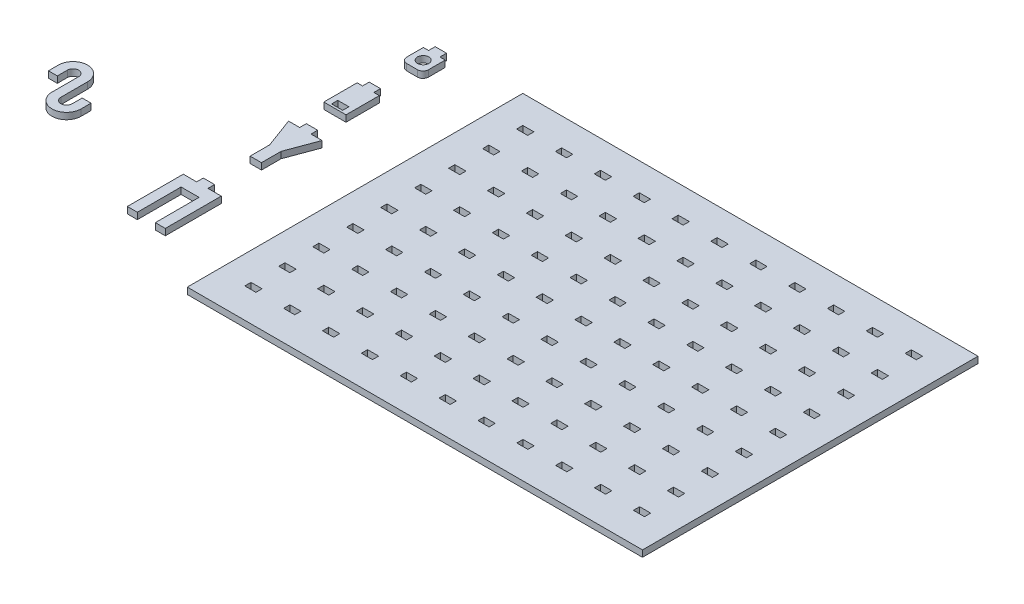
from build123d import *

# Parameters (mm, degrees)
SKETCH1_W             = 410
SKETCH1_H             = 302.2
SKETCH1_W_2           = 10
SKETCH1_H_2           = 5.6
BOSS_EXTRUDE5_DEPTH   = 5.8
SKETCH1_R             = 5.126
BOSS_EXTRUDE5_2_DEPTH = 5.8
BOSS_EXTRUDE5_3_DEPTH = 5.8
BOSS_EXTRUDE5_4_DEPTH = 5.8
BOSS_EXTRUDE5_5_DEPTH = 5.8
BOSS_EXTRUDE5_6_DEPTH = 5.8


with BuildPart() as part:
    # Sketch1 → Boss-Extrude5 (new body)
    with BuildSketch(Plane(origin=(0, 0, 0), x_dir=(1, 0, 0), z_dir=(0, 1, 0))):
        with Locations((5, -3.685365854)):
            Rectangle(SKETCH1_W, SKETCH1_H)
        with Locations((-135, 119.614634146)):
            Rectangle(SKETCH1_W_2, SKETCH1_H_2, mode=Mode.SUBTRACT)
        with Locations((-170, 119.614634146)):
            Rectangle(SKETCH1_W_2, SKETCH1_H_2, mode=Mode.SUBTRACT)
        with Locations((-100, 119.614634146)):
            Rectangle(SKETCH1_W_2, SKETCH1_H_2, mode=Mode.SUBTRACT)
        with Locations((-65, 119.614634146)):
            Rectangle(SKETCH1_W_2, SKETCH1_H_2, mode=Mode.SUBTRACT)
        with Locations((-30, 119.614634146)):
            Rectangle(SKETCH1_W_2, SKETCH1_H_2, mode=Mode.SUBTRACT)
        with Locations((5, 119.614634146)):
            Rectangle(SKETCH1_W_2, SKETCH1_H_2, mode=Mode.SUBTRACT)
        with Locations((40, 119.614634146)):
            Rectangle(SKETCH1_W_2, SKETCH1_H_2, mode=Mode.SUBTRACT)
        with Locations((75, 119.614634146)):
            Rectangle(SKETCH1_W_2, SKETCH1_H_2, mode=Mode.SUBTRACT)
        with Locations((110, 119.614634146)):
            Rectangle(SKETCH1_W_2, SKETCH1_H_2, mode=Mode.SUBTRACT)
        with Locations((145, 119.614634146)):
            Rectangle(SKETCH1_W_2, SKETCH1_H_2, mode=Mode.SUBTRACT)
        with Locations((180, 119.614634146)):
            Rectangle(SKETCH1_W_2, SKETCH1_H_2, mode=Mode.SUBTRACT)
        with Locations((-135, 89.014634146)):
            Rectangle(SKETCH1_W_2, SKETCH1_H_2, mode=Mode.SUBTRACT)
        with Locations((-100, 89.014634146)):
            Rectangle(SKETCH1_W_2, SKETCH1_H_2, mode=Mode.SUBTRACT)
        with Locations((-65, 89.014634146)):
            Rectangle(SKETCH1_W_2, SKETCH1_H_2, mode=Mode.SUBTRACT)
        with Locations((-30, 89.014634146)):
            Rectangle(SKETCH1_W_2, SKETCH1_H_2, mode=Mode.SUBTRACT)
        with Locations((5, 89.014634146)):
            Rectangle(SKETCH1_W_2, SKETCH1_H_2, mode=Mode.SUBTRACT)
        with Locations((40, 89.014634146)):
            Rectangle(SKETCH1_W_2, SKETCH1_H_2, mode=Mode.SUBTRACT)
        with Locations((75, 89.014634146)):
            Rectangle(SKETCH1_W_2, SKETCH1_H_2, mode=Mode.SUBTRACT)
        with Locations((110, 89.014634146)):
            Rectangle(SKETCH1_W_2, SKETCH1_H_2, mode=Mode.SUBTRACT)
        with Locations((145, 89.014634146)):
            Rectangle(SKETCH1_W_2, SKETCH1_H_2, mode=Mode.SUBTRACT)
        with Locations((180, 89.014634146)):
            Rectangle(SKETCH1_W_2, SKETCH1_H_2, mode=Mode.SUBTRACT)
        with Locations((-135, 58.414634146)):
            Rectangle(SKETCH1_W_2, SKETCH1_H_2, mode=Mode.SUBTRACT)
        with Locations((-100, 58.414634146)):
            Rectangle(SKETCH1_W_2, SKETCH1_H_2, mode=Mode.SUBTRACT)
        with Locations((-65, 58.414634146)):
            Rectangle(SKETCH1_W_2, SKETCH1_H_2, mode=Mode.SUBTRACT)
        with Locations((-30, 58.414634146)):
            Rectangle(SKETCH1_W_2, SKETCH1_H_2, mode=Mode.SUBTRACT)
        with Locations((5, 58.414634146)):
            Rectangle(SKETCH1_W_2, SKETCH1_H_2, mode=Mode.SUBTRACT)
        with Locations((40, 58.414634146)):
            Rectangle(SKETCH1_W_2, SKETCH1_H_2, mode=Mode.SUBTRACT)
        with Locations((75, 58.414634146)):
            Rectangle(SKETCH1_W_2, SKETCH1_H_2, mode=Mode.SUBTRACT)
        with Locations((110, 58.414634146)):
            Rectangle(SKETCH1_W_2, SKETCH1_H_2, mode=Mode.SUBTRACT)
        with Locations((145, 58.414634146)):
            Rectangle(SKETCH1_W_2, SKETCH1_H_2, mode=Mode.SUBTRACT)
        with Locations((180, 58.414634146)):
            Rectangle(SKETCH1_W_2, SKETCH1_H_2, mode=Mode.SUBTRACT)
        with Locations((-135, 27.814634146)):
            Rectangle(SKETCH1_W_2, SKETCH1_H_2, mode=Mode.SUBTRACT)
        with Locations((-100, 27.814634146)):
            Rectangle(SKETCH1_W_2, SKETCH1_H_2, mode=Mode.SUBTRACT)
        with Locations((-65, 27.814634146)):
            Rectangle(SKETCH1_W_2, SKETCH1_H_2, mode=Mode.SUBTRACT)
        with Locations((-30, 27.814634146)):
            Rectangle(SKETCH1_W_2, SKETCH1_H_2, mode=Mode.SUBTRACT)
        with Locations((5, 27.814634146)):
            Rectangle(SKETCH1_W_2, SKETCH1_H_2, mode=Mode.SUBTRACT)
        with Locations((40, 27.814634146)):
            Rectangle(SKETCH1_W_2, SKETCH1_H_2, mode=Mode.SUBTRACT)
        with Locations((75, 27.814634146)):
            Rectangle(SKETCH1_W_2, SKETCH1_H_2, mode=Mode.SUBTRACT)
        with Locations((110, 27.814634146)):
            Rectangle(SKETCH1_W_2, SKETCH1_H_2, mode=Mode.SUBTRACT)
        with Locations((145, 27.814634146)):
            Rectangle(SKETCH1_W_2, SKETCH1_H_2, mode=Mode.SUBTRACT)
        with Locations((180, 27.814634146)):
            Rectangle(SKETCH1_W_2, SKETCH1_H_2, mode=Mode.SUBTRACT)
        with Locations((-135, -2.785365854)):
            Rectangle(SKETCH1_W_2, SKETCH1_H_2, mode=Mode.SUBTRACT)
        with Locations((-100, -2.785365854)):
            Rectangle(SKETCH1_W_2, SKETCH1_H_2, mode=Mode.SUBTRACT)
        with Locations((-65, -2.785365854)):
            Rectangle(SKETCH1_W_2, SKETCH1_H_2, mode=Mode.SUBTRACT)
        with Locations((-30, -2.785365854)):
            Rectangle(SKETCH1_W_2, SKETCH1_H_2, mode=Mode.SUBTRACT)
        with Locations((5, -2.785365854)):
            Rectangle(SKETCH1_W_2, SKETCH1_H_2, mode=Mode.SUBTRACT)
        with Locations((40, -2.785365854)):
            Rectangle(SKETCH1_W_2, SKETCH1_H_2, mode=Mode.SUBTRACT)
        with Locations((75, -2.785365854)):
            Rectangle(SKETCH1_W_2, SKETCH1_H_2, mode=Mode.SUBTRACT)
        with Locations((110, -2.785365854)):
            Rectangle(SKETCH1_W_2, SKETCH1_H_2, mode=Mode.SUBTRACT)
        with Locations((145, -2.785365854)):
            Rectangle(SKETCH1_W_2, SKETCH1_H_2, mode=Mode.SUBTRACT)
        with Locations((180, -2.785365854)):
            Rectangle(SKETCH1_W_2, SKETCH1_H_2, mode=Mode.SUBTRACT)
        with Locations((-135, -33.385365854)):
            Rectangle(SKETCH1_W_2, SKETCH1_H_2, mode=Mode.SUBTRACT)
        with Locations((-100, -33.385365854)):
            Rectangle(SKETCH1_W_2, SKETCH1_H_2, mode=Mode.SUBTRACT)
        with Locations((-65, -33.385365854)):
            Rectangle(SKETCH1_W_2, SKETCH1_H_2, mode=Mode.SUBTRACT)
        with Locations((-30, -33.385365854)):
            Rectangle(SKETCH1_W_2, SKETCH1_H_2, mode=Mode.SUBTRACT)
        with Locations((5, -33.385365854)):
            Rectangle(SKETCH1_W_2, SKETCH1_H_2, mode=Mode.SUBTRACT)
        with Locations((40, -33.385365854)):
            Rectangle(SKETCH1_W_2, SKETCH1_H_2, mode=Mode.SUBTRACT)
        with Locations((75, -33.385365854)):
            Rectangle(SKETCH1_W_2, SKETCH1_H_2, mode=Mode.SUBTRACT)
        with Locations((110, -33.385365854)):
            Rectangle(SKETCH1_W_2, SKETCH1_H_2, mode=Mode.SUBTRACT)
        with Locations((145, -33.385365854)):
            Rectangle(SKETCH1_W_2, SKETCH1_H_2, mode=Mode.SUBTRACT)
        with Locations((180, -33.385365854)):
            Rectangle(SKETCH1_W_2, SKETCH1_H_2, mode=Mode.SUBTRACT)
        with Locations((-135, -63.985365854)):
            Rectangle(SKETCH1_W_2, SKETCH1_H_2, mode=Mode.SUBTRACT)
        with Locations((-100, -63.985365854)):
            Rectangle(SKETCH1_W_2, SKETCH1_H_2, mode=Mode.SUBTRACT)
        with Locations((-65, -63.985365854)):
            Rectangle(SKETCH1_W_2, SKETCH1_H_2, mode=Mode.SUBTRACT)
        with Locations((-30, -63.985365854)):
            Rectangle(SKETCH1_W_2, SKETCH1_H_2, mode=Mode.SUBTRACT)
        with Locations((5, -63.985365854)):
            Rectangle(SKETCH1_W_2, SKETCH1_H_2, mode=Mode.SUBTRACT)
        with Locations((40, -63.985365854)):
            Rectangle(SKETCH1_W_2, SKETCH1_H_2, mode=Mode.SUBTRACT)
        with Locations((75, -63.985365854)):
            Rectangle(SKETCH1_W_2, SKETCH1_H_2, mode=Mode.SUBTRACT)
        with Locations((110, -63.985365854)):
            Rectangle(SKETCH1_W_2, SKETCH1_H_2, mode=Mode.SUBTRACT)
        with Locations((145, -63.985365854)):
            Rectangle(SKETCH1_W_2, SKETCH1_H_2, mode=Mode.SUBTRACT)
        with Locations((180, -63.985365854)):
            Rectangle(SKETCH1_W_2, SKETCH1_H_2, mode=Mode.SUBTRACT)
        with Locations((-135, -94.585365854)):
            Rectangle(SKETCH1_W_2, SKETCH1_H_2, mode=Mode.SUBTRACT)
        with Locations((-100, -94.585365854)):
            Rectangle(SKETCH1_W_2, SKETCH1_H_2, mode=Mode.SUBTRACT)
        with Locations((-65, -94.585365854)):
            Rectangle(SKETCH1_W_2, SKETCH1_H_2, mode=Mode.SUBTRACT)
        with Locations((-30, -94.585365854)):
            Rectangle(SKETCH1_W_2, SKETCH1_H_2, mode=Mode.SUBTRACT)
        with Locations((5, -94.585365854)):
            Rectangle(SKETCH1_W_2, SKETCH1_H_2, mode=Mode.SUBTRACT)
        with Locations((40, -94.585365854)):
            Rectangle(SKETCH1_W_2, SKETCH1_H_2, mode=Mode.SUBTRACT)
        with Locations((75, -94.585365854)):
            Rectangle(SKETCH1_W_2, SKETCH1_H_2, mode=Mode.SUBTRACT)
        with Locations((110, -94.585365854)):
            Rectangle(SKETCH1_W_2, SKETCH1_H_2, mode=Mode.SUBTRACT)
        with Locations((145, -94.585365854)):
            Rectangle(SKETCH1_W_2, SKETCH1_H_2, mode=Mode.SUBTRACT)
        with Locations((180, -94.585365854)):
            Rectangle(SKETCH1_W_2, SKETCH1_H_2, mode=Mode.SUBTRACT)
        with Locations((-135, -125.185365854)):
            Rectangle(SKETCH1_W_2, SKETCH1_H_2, mode=Mode.SUBTRACT)
        with Locations((-100, -125.185365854)):
            Rectangle(SKETCH1_W_2, SKETCH1_H_2, mode=Mode.SUBTRACT)
        with Locations((-65, -125.185365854)):
            Rectangle(SKETCH1_W_2, SKETCH1_H_2, mode=Mode.SUBTRACT)
        with Locations((-30, -125.185365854)):
            Rectangle(SKETCH1_W_2, SKETCH1_H_2, mode=Mode.SUBTRACT)
        with Locations((5, -125.185365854)):
            Rectangle(SKETCH1_W_2, SKETCH1_H_2, mode=Mode.SUBTRACT)
        with Locations((40, -125.185365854)):
            Rectangle(SKETCH1_W_2, SKETCH1_H_2, mode=Mode.SUBTRACT)
        with Locations((75, -125.185365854)):
            Rectangle(SKETCH1_W_2, SKETCH1_H_2, mode=Mode.SUBTRACT)
        with Locations((110, -125.185365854)):
            Rectangle(SKETCH1_W_2, SKETCH1_H_2, mode=Mode.SUBTRACT)
        with Locations((145, -125.185365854)):
            Rectangle(SKETCH1_W_2, SKETCH1_H_2, mode=Mode.SUBTRACT)
        with Locations((180, -125.185365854)):
            Rectangle(SKETCH1_W_2, SKETCH1_H_2, mode=Mode.SUBTRACT)
        with Locations((-170, 89.014634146)):
            Rectangle(SKETCH1_W_2, SKETCH1_H_2, mode=Mode.SUBTRACT)
        with Locations((-170, 58.414634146)):
            Rectangle(SKETCH1_W_2, SKETCH1_H_2, mode=Mode.SUBTRACT)
        with Locations((-170, 27.814634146)):
            Rectangle(SKETCH1_W_2, SKETCH1_H_2, mode=Mode.SUBTRACT)
        with Locations((-170, -2.785365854)):
            Rectangle(SKETCH1_W_2, SKETCH1_H_2, mode=Mode.SUBTRACT)
        with Locations((-170, -33.385365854)):
            Rectangle(SKETCH1_W_2, SKETCH1_H_2, mode=Mode.SUBTRACT)
        with Locations((-170, -63.985365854)):
            Rectangle(SKETCH1_W_2, SKETCH1_H_2, mode=Mode.SUBTRACT)
        with Locations((-170, -94.585365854)):
            Rectangle(SKETCH1_W_2, SKETCH1_H_2, mode=Mode.SUBTRACT)
        with Locations((-170, -125.185365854)):
            Rectangle(SKETCH1_W_2, SKETCH1_H_2, mode=Mode.SUBTRACT)
    extrude(amount=BOSS_EXTRUDE5_DEPTH)


with BuildPart() as body_2:
    # Sketch1 → Boss-Extrude5 2 (new body)
    with BuildSketch(Plane(origin=(0, 0, 0), x_dir=(1, 0, 0), z_dir=(0, 1, 0))):
        with BuildLine():
            Line((-275.888809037, 144.394474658), (-265.688809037, 144.394474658))
            Line((-265.688809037, 144.394474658), (-265.688809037, 138.444474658))
            Line((-265.688809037, 138.444474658), (-260.936730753, 138.444474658))
            Line((-260.936730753, 138.444474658), (-260.936730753, 123.444474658))
            ThreePointArc((-260.936730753, 123.444474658), (-262.401196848, 119.908940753), (-265.936730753, 118.444474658))
            Line((-265.936730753, 118.444474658), (-275.588887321, 118.444474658))
            ThreePointArc((-275.588887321, 118.444474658), (-279.124421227, 119.908940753), (-280.588887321, 123.444474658))
            Line((-280.588887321, 123.444474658), (-280.588887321, 138.444474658))
            Line((-280.588887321, 138.444474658), (-275.888809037, 138.444474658))
            Line((-275.888809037, 138.444474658), (-275.888809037, 144.394474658))
        make_face()
        with Locations(Location((-270.762809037, 128.444474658, 0), (0, 0, 270))):
            Circle(SKETCH1_R, mode=Mode.SUBTRACT)
    extrude(amount=BOSS_EXTRUDE5_2_DEPTH)


with BuildPart() as body_3:
    # Sketch1 → Boss-Extrude5 3 (new body)
    with BuildSketch(Plane(origin=(0, 0, 0), x_dir=(1, 0, 0), z_dir=(0, 1, 0))):
        Polygon((-277.977013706, 87.0583391), (-267.777013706, 87.0583391), (-267.777013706, 81.0583391), (-262.881648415, 81.0583391), (-262.881648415, 51.0583391), (-282.872378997, 51.0583391), (-282.872378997, 81.0583391), (-277.977013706, 81.0583391), align=None)
        with Locations((-272.877013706, 55.871595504)):
            Rectangle(SKETCH1_W_2, SKETCH1_H_2, mode=Mode.SUBTRACT)
    extrude(amount=BOSS_EXTRUDE5_3_DEPTH)


with BuildPart() as body_4:
    # Sketch1 → Boss-Extrude5 4 (new body)
    with BuildSketch(Plane(origin=(0, 0, 0), x_dir=(1, 0, 0), z_dir=(0, 1, 0))):
        Polygon((-263.648604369, 20.303398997), (-263.648604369, 26.303398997), (-273.848604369, 26.303398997), (-273.848604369, 20.303398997), (-283.877469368, 20.303398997), (-273.848604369, -6.687912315), (-273.848604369, -24.322235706), (-263.648604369, -24.322235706), (-263.648604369, -6.687912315), (-253.619739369, 20.303398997), align=None)
    extrude(amount=BOSS_EXTRUDE5_4_DEPTH)


with BuildPart() as body_5:
    # Sketch1 → Boss-Extrude5 5 (new body)
    with BuildSketch(Plane(origin=(0, 0, 0), x_dir=(1, 0, 0), z_dir=(0, 1, 0))):
        Polygon((-267.677013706, -68.497931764), (-267.677013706, -62.497931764), (-277.877013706, -62.497931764), (-277.877013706, -68.497931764), (-289.877013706, -68.497931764), (-289.877013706, -118.893474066), (-280.877013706, -118.893474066), (-280.877013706, -79.497931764), (-264.677013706, -79.497931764), (-264.677013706, -118.893474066), (-255.677013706, -118.893474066), (-255.677013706, -68.497931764), align=None)
    extrude(amount=BOSS_EXTRUDE5_5_DEPTH)


with BuildPart() as body_6:
    # Sketch1 → Boss-Extrude5 6 (new body)
    with BuildSketch(Plane(origin=(0, 0, 0), x_dir=(1, 0, 0), z_dir=(0, 1, 0))):
        with BuildLine():
            Line((-413.029373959, -39.610497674), (-413.029373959, -63.610497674))
            ThreePointArc((-413.029373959, -63.610497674), (-399.929373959, -76.710497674), (-386.829373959, -63.610497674))
            Line((-386.829373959, -63.610497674), (-386.829373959, -54.610497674))
            Line((-386.829373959, -54.610497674), (-394.829373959, -54.610497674))
            Line((-394.829373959, -54.610497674), (-394.829373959, -63.610497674))
            ThreePointArc((-394.829373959, -63.610497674), (-399.929373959, -68.710497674), (-405.029373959, -63.610497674))
            Line((-405.029373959, -63.610497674), (-405.029373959, -39.610497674))
            ThreePointArc((-405.029373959, -39.610497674), (-418.129373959, -26.510497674), (-431.229373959, -39.610497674))
            Line((-431.229373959, -39.610497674), (-431.229373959, -48.610497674))
            Line((-431.229373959, -48.610497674), (-423.229373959, -48.610497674))
            Line((-423.229373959, -48.610497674), (-423.229373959, -39.610497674))
            ThreePointArc((-423.229373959, -39.610497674), (-418.129373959, -34.510497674), (-413.029373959, -39.610497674))
        make_face()
    extrude(amount=BOSS_EXTRUDE5_6_DEPTH)


solid = Compound([part.part, body_2.part, body_3.part, body_4.part, body_5.part, body_6.part])
